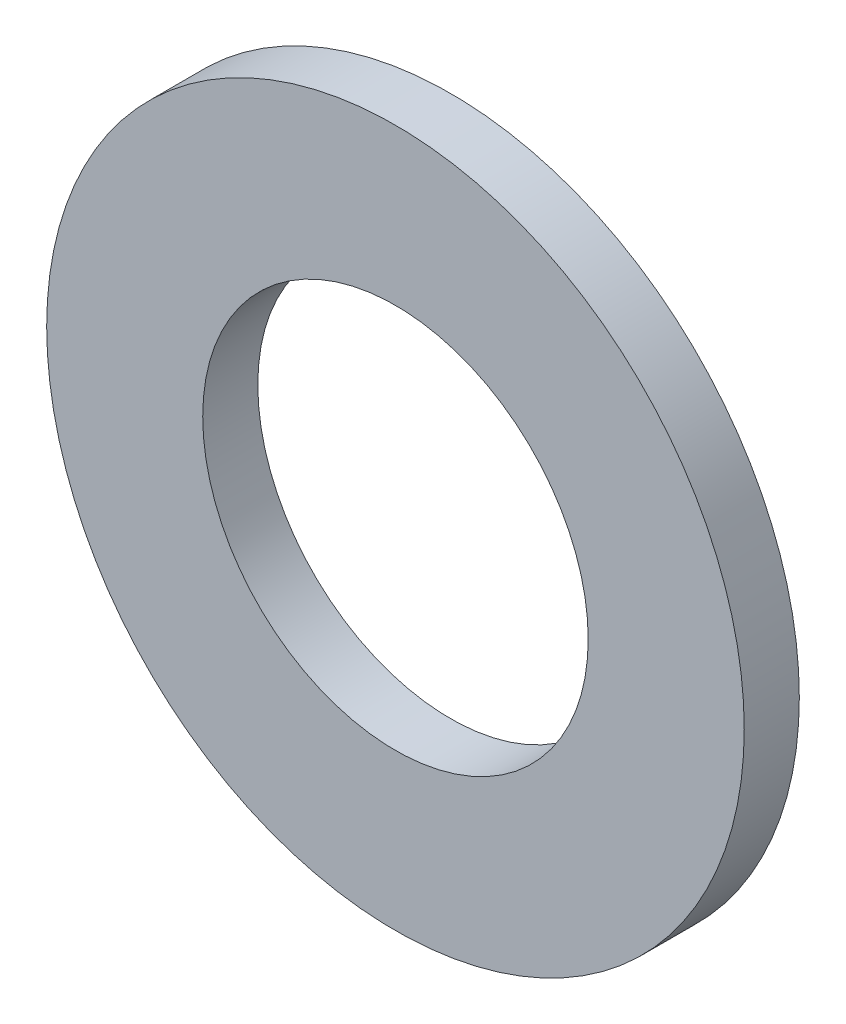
from build123d import *

# Parameters (mm, degrees)
SZKIC1_R                    = 9.5
SZKIC1_R_2                  = 5.25
DODANIE_WYCI_GNI_CIE1_DEPTH = 1.5


with BuildPart() as part:
    # Szkic1 → Dodanie-wyci_gni_cie1 (new body)
    with BuildSketch(Plane.XY):
        Circle(SZKIC1_R)
        Circle(SZKIC1_R_2, mode=Mode.SUBTRACT)
    extrude(amount=DODANIE_WYCI_GNI_CIE1_DEPTH)


solid = part.part
